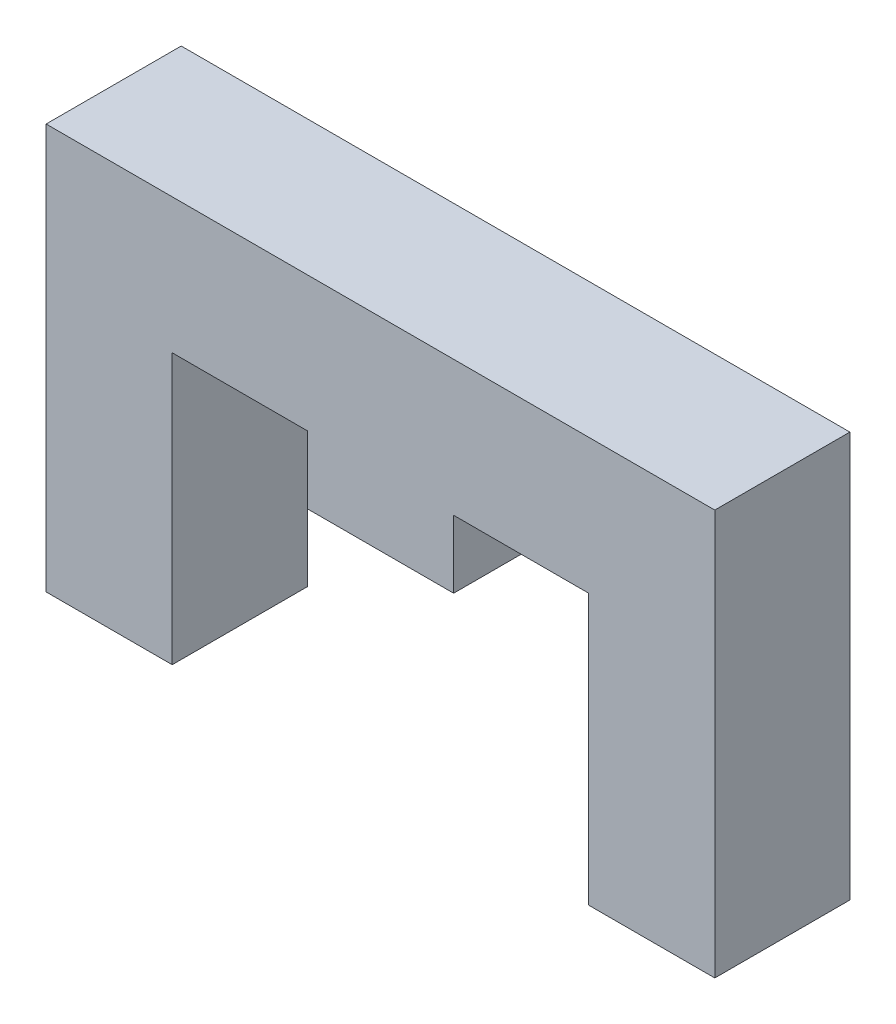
ISO-10303-21;
HEADER;
FILE_DESCRIPTION(('STEP AP214'),'2;1');
FILE_NAME('part.step','',(''),(''),'','','');
FILE_SCHEMA(('AUTOMOTIVE_DESIGN { 1 0 10303 214 1 1 1 1 }'));
ENDSEC;
DATA;
#1=APPLICATION_CONTEXT('core data for automotive mechanical design processes');
#2=APPLICATION_PROTOCOL_DEFINITION('international standard','automotive_design',2000,#1);
#3=PRODUCT_CONTEXT('',#1,'mechanical');
#4=PRODUCT('Part','Part','',(#3));
#5=PRODUCT_RELATED_PRODUCT_CATEGORY('part','',(#4));
#6=PRODUCT_DEFINITION_FORMATION('','',#4);
#7=PRODUCT_DEFINITION_CONTEXT('part definition',#1,'design');
#8=PRODUCT_DEFINITION('design','',#6,#7);
#9=PRODUCT_DEFINITION_SHAPE('','',#8);
#10=(LENGTH_UNIT() NAMED_UNIT(*) SI_UNIT(.MILLI.,.METRE.));
#11=(NAMED_UNIT(*) PLANE_ANGLE_UNIT() SI_UNIT($,.RADIAN.));
#12=(NAMED_UNIT(*) SI_UNIT($,.STERADIAN.) SOLID_ANGLE_UNIT());
#13=UNCERTAINTY_MEASURE_WITH_UNIT(LENGTH_MEASURE(1.E-05),#10,'distance_accuracy_value','');
#14=(GEOMETRIC_REPRESENTATION_CONTEXT(3) GLOBAL_UNCERTAINTY_ASSIGNED_CONTEXT((#13)) GLOBAL_UNIT_ASSIGNED_CONTEXT((#10,
#11,#12)) REPRESENTATION_CONTEXT('',''));
#15=CARTESIAN_POINT('',(0.,0.,0.));
#16=DIRECTION('',(0.,0.,1.));
#17=DIRECTION('',(1.,0.,0.));
#18=AXIS2_PLACEMENT_3D('',#15,#16,#17);
#19=CARTESIAN_POINT('',(-17.85,-3.,3.));
#20=DIRECTION('',(0.,1.,0.));
#21=DIRECTION('',(-1.,0.,0.));
#22=AXIS2_PLACEMENT_3D('',#19,#20,#21);
#23=PLANE('',#22);
#24=DIRECTION('',(1.,0.,0.));
#25=VECTOR('',#24,1.);
#26=CARTESIAN_POINT('',(-17.85,-3.,0.));
#27=LINE('',#26,#25);
#28=CARTESIAN_POINT('',(-17.85,-3.,0.));
#29=VERTEX_POINT('',#28);
#30=CARTESIAN_POINT('',(-15.05,-3.,0.));
#31=VERTEX_POINT('',#30);
#32=EDGE_CURVE('E141',#29,#31,#27,.T.);
#33=ORIENTED_EDGE('',*,*,#32,.T.);
#34=DIRECTION('',(0.,0.,-1.));
#35=VECTOR('',#34,1.);
#36=CARTESIAN_POINT('',(-15.05,-3.,3.));
#37=LINE('',#36,#35);
#38=CARTESIAN_POINT('',(-15.05,-3.,3.));
#39=VERTEX_POINT('',#38);
#40=EDGE_CURVE('E25',#39,#31,#37,.T.);
#41=ORIENTED_EDGE('',*,*,#40,.F.);
#42=DIRECTION('',(1.,0.,0.));
#43=VECTOR('',#42,1.);
#44=CARTESIAN_POINT('',(-17.85,-3.,3.));
#45=LINE('',#44,#43);
#46=CARTESIAN_POINT('',(-17.85,-3.,3.));
#47=VERTEX_POINT('',#46);
#48=EDGE_CURVE('E89',#47,#39,#45,.T.);
#49=ORIENTED_EDGE('',*,*,#48,.F.);
#50=DIRECTION('',(0.,0.,-1.));
#51=VECTOR('',#50,1.);
#52=CARTESIAN_POINT('',(-17.85,-3.,3.));
#53=LINE('',#52,#51);
#54=EDGE_CURVE('E11',#47,#29,#53,.T.);
#55=ORIENTED_EDGE('',*,*,#54,.T.);
#56=EDGE_LOOP('',(#33,#41,#49,#55));
#57=FACE_BOUND('',#56,.T.);
#58=ADVANCED_FACE('F17',(#57),#23,.F.);
#59=CARTESIAN_POINT('',(-15.05,0.,3.));
#60=DIRECTION('',(-1.,0.,0.));
#61=DIRECTION('',(0.,-1.,0.));
#62=AXIS2_PLACEMENT_3D('',#59,#60,#61);
#63=PLANE('',#62);
#64=DIRECTION('',(0.,1.,0.));
#65=VECTOR('',#64,1.);
#66=CARTESIAN_POINT('',(-15.05,0.,0.));
#67=LINE('',#66,#65);
#68=CARTESIAN_POINT('',(-15.05,6.,0.));
#69=VERTEX_POINT('',#68);
#70=EDGE_CURVE('E144',#31,#69,#67,.T.);
#71=ORIENTED_EDGE('',*,*,#70,.T.);
#72=DIRECTION('',(0.,0.,-1.));
#73=VECTOR('',#72,1.);
#74=CARTESIAN_POINT('',(-15.05,6.,3.));
#75=LINE('',#74,#73);
#76=CARTESIAN_POINT('',(-15.05,6.,3.));
#77=VERTEX_POINT('',#76);
#78=EDGE_CURVE('E183',#77,#69,#75,.T.);
#79=ORIENTED_EDGE('',*,*,#78,.F.);
#80=DIRECTION('',(0.,1.,0.));
#81=VECTOR('',#80,1.);
#82=CARTESIAN_POINT('',(-15.05,-3.,3.));
#83=LINE('',#82,#81);
#84=EDGE_CURVE('E190',#39,#77,#83,.T.);
#85=ORIENTED_EDGE('',*,*,#84,.F.);
#86=ORIENTED_EDGE('',*,*,#40,.T.);
#87=EDGE_LOOP('',(#71,#79,#85,#86));
#88=FACE_BOUND('',#87,.T.);
#89=ADVANCED_FACE('F188',(#88),#63,.F.);
#90=CARTESIAN_POINT('',(-15.05,6.,3.));
#91=DIRECTION('',(0.,-1.,0.));
#92=DIRECTION('',(1.,0.,0.));
#93=AXIS2_PLACEMENT_3D('',#90,#91,#92);
#94=PLANE('',#93);
#95=DIRECTION('',(-1.,0.,0.));
#96=VECTOR('',#95,1.);
#97=CARTESIAN_POINT('',(-15.05,6.,0.));
#98=LINE('',#97,#96);
#99=CARTESIAN_POINT('',(-29.9,6.,0.));
#100=VERTEX_POINT('',#99);
#101=EDGE_CURVE('E146',#69,#100,#98,.T.);
#102=ORIENTED_EDGE('',*,*,#101,.T.);
#103=DIRECTION('',(0.,0.,-1.));
#104=VECTOR('',#103,1.);
#105=CARTESIAN_POINT('',(-29.9,6.,3.));
#106=LINE('',#105,#104);
#107=CARTESIAN_POINT('',(-29.9,6.,3.));
#108=VERTEX_POINT('',#107);
#109=EDGE_CURVE('E180',#108,#100,#106,.T.);
#110=ORIENTED_EDGE('',*,*,#109,.F.);
#111=DIRECTION('',(-1.,0.,0.));
#112=VECTOR('',#111,1.);
#113=CARTESIAN_POINT('',(-15.05,6.,3.));
#114=LINE('',#113,#112);
#115=EDGE_CURVE('E208',#77,#108,#114,.T.);
#116=ORIENTED_EDGE('',*,*,#115,.F.);
#117=ORIENTED_EDGE('',*,*,#78,.T.);
#118=EDGE_LOOP('',(#102,#110,#116,#117));
#119=FACE_BOUND('',#118,.T.);
#120=ADVANCED_FACE('F199',(#119),#94,.F.);
#121=CARTESIAN_POINT('',(-29.9,0.,3.));
#122=DIRECTION('',(1.,0.,0.));
#123=DIRECTION('',(0.,0.,-1.));
#124=AXIS2_PLACEMENT_3D('',#121,#122,#123);
#125=PLANE('',#124);
#126=DIRECTION('',(0.,-1.,0.));
#127=VECTOR('',#126,1.);
#128=CARTESIAN_POINT('',(-29.9,0.,0.));
#129=LINE('',#128,#127);
#130=CARTESIAN_POINT('',(-29.9,-3.,0.));
#131=VERTEX_POINT('',#130);
#132=EDGE_CURVE('E149',#100,#131,#129,.T.);
#133=ORIENTED_EDGE('',*,*,#132,.T.);
#134=DIRECTION('',(0.,0.,-1.));
#135=VECTOR('',#134,1.);
#136=CARTESIAN_POINT('',(-29.9,-3.,3.));
#137=LINE('',#136,#135);
#138=CARTESIAN_POINT('',(-29.9,-3.,3.));
#139=VERTEX_POINT('',#138);
#140=EDGE_CURVE('E177',#139,#131,#137,.T.);
#141=ORIENTED_EDGE('',*,*,#140,.F.);
#142=DIRECTION('',(0.,-1.,0.));
#143=VECTOR('',#142,1.);
#144=CARTESIAN_POINT('',(-29.9,0.,3.));
#145=LINE('',#144,#143);
#146=EDGE_CURVE('E205',#108,#139,#145,.T.);
#147=ORIENTED_EDGE('',*,*,#146,.F.);
#148=ORIENTED_EDGE('',*,*,#109,.T.);
#149=EDGE_LOOP('',(#133,#141,#147,#148));
#150=FACE_BOUND('',#149,.T.);
#151=ADVANCED_FACE('F203',(#150),#125,.F.);
#152=CARTESIAN_POINT('',(-29.9,-3.,3.));
#153=DIRECTION('',(0.,1.,0.));
#154=DIRECTION('',(-1.,0.,0.));
#155=AXIS2_PLACEMENT_3D('',#152,#153,#154);
#156=PLANE('',#155);
#157=DIRECTION('',(1.,0.,0.));
#158=VECTOR('',#157,1.);
#159=CARTESIAN_POINT('',(-29.9,-3.,0.));
#160=LINE('',#159,#158);
#161=CARTESIAN_POINT('',(-27.1,-3.,0.));
#162=VERTEX_POINT('',#161);
#163=EDGE_CURVE('E151',#131,#162,#160,.T.);
#164=ORIENTED_EDGE('',*,*,#163,.T.);
#165=DIRECTION('',(0.,0.,-1.));
#166=VECTOR('',#165,1.);
#167=CARTESIAN_POINT('',(-27.1,-3.,3.));
#168=LINE('',#167,#166);
#169=CARTESIAN_POINT('',(-27.1,-3.,3.));
#170=VERTEX_POINT('',#169);
#171=EDGE_CURVE('E174',#170,#162,#168,.T.);
#172=ORIENTED_EDGE('',*,*,#171,.F.);
#173=DIRECTION('',(1.,0.,0.));
#174=VECTOR('',#173,1.);
#175=CARTESIAN_POINT('',(-29.9,-3.,3.));
#176=LINE('',#175,#174);
#177=EDGE_CURVE('E207',#139,#170,#176,.T.);
#178=ORIENTED_EDGE('',*,*,#177,.F.);
#179=ORIENTED_EDGE('',*,*,#140,.T.);
#180=EDGE_LOOP('',(#164,#172,#178,#179));
#181=FACE_BOUND('',#180,.T.);
#182=ADVANCED_FACE('F230',(#181),#156,.F.);
#183=CARTESIAN_POINT('',(-27.1,0.,3.));
#184=DIRECTION('',(-1.,0.,0.));
#185=DIRECTION('',(0.,-1.,0.));
#186=AXIS2_PLACEMENT_3D('',#183,#184,#185);
#187=PLANE('',#186);
#188=DIRECTION('',(0.,1.,0.));
#189=VECTOR('',#188,1.);
#190=CARTESIAN_POINT('',(-27.1,0.,0.));
#191=LINE('',#190,#189);
#192=CARTESIAN_POINT('',(-27.1,3.,0.));
#193=VERTEX_POINT('',#192);
#194=EDGE_CURVE('E154',#162,#193,#191,.T.);
#195=ORIENTED_EDGE('',*,*,#194,.T.);
#196=DIRECTION('',(0.,0.,-1.));
#197=VECTOR('',#196,1.);
#198=CARTESIAN_POINT('',(-27.1,3.,3.));
#199=LINE('',#198,#197);
#200=CARTESIAN_POINT('',(-27.1,3.,3.));
#201=VERTEX_POINT('',#200);
#202=EDGE_CURVE('E171',#201,#193,#199,.T.);
#203=ORIENTED_EDGE('',*,*,#202,.F.);
#204=DIRECTION('',(0.,1.,0.));
#205=VECTOR('',#204,1.);
#206=CARTESIAN_POINT('',(-27.1,-3.,3.));
#207=LINE('',#206,#205);
#208=EDGE_CURVE('E210',#170,#201,#207,.T.);
#209=ORIENTED_EDGE('',*,*,#208,.F.);
#210=ORIENTED_EDGE('',*,*,#171,.T.);
#211=EDGE_LOOP('',(#195,#203,#209,#210));
#212=FACE_BOUND('',#211,.T.);
#213=ADVANCED_FACE('F231',(#212),#187,.F.);
#214=CARTESIAN_POINT('',(-27.1,3.,3.));
#215=DIRECTION('',(0.,1.,0.));
#216=DIRECTION('',(0.,0.,1.));
#217=AXIS2_PLACEMENT_3D('',#214,#215,#216);
#218=PLANE('',#217);
#219=DIRECTION('',(1.,0.,0.));
#220=VECTOR('',#219,1.);
#221=CARTESIAN_POINT('',(-27.1,3.,0.));
#222=LINE('',#221,#220);
#223=CARTESIAN_POINT('',(-24.1,3.,0.));
#224=VERTEX_POINT('',#223);
#225=EDGE_CURVE('E156',#193,#224,#222,.T.);
#226=ORIENTED_EDGE('',*,*,#225,.T.);
#227=DIRECTION('',(0.,0.,-1.));
#228=VECTOR('',#227,1.);
#229=CARTESIAN_POINT('',(-24.1,3.,3.));
#230=LINE('',#229,#228);
#231=CARTESIAN_POINT('',(-24.1,3.,3.));
#232=VERTEX_POINT('',#231);
#233=EDGE_CURVE('E168',#232,#224,#230,.T.);
#234=ORIENTED_EDGE('',*,*,#233,.F.);
#235=DIRECTION('',(1.,0.,0.));
#236=VECTOR('',#235,1.);
#237=CARTESIAN_POINT('',(-27.1,3.,3.));
#238=LINE('',#237,#236);
#239=EDGE_CURVE('E216',#201,#232,#238,.T.);
#240=ORIENTED_EDGE('',*,*,#239,.F.);
#241=ORIENTED_EDGE('',*,*,#202,.T.);
#242=EDGE_LOOP('',(#226,#234,#240,#241));
#243=FACE_BOUND('',#242,.T.);
#244=ADVANCED_FACE('F222',(#243),#218,.F.);
#245=CARTESIAN_POINT('',(-24.1,3.,3.));
#246=DIRECTION('',(1.,0.,0.));
#247=DIRECTION('',(0.,0.,-1.));
#248=AXIS2_PLACEMENT_3D('',#245,#246,#247);
#249=PLANE('',#248);
#250=DIRECTION('',(0.,-1.,0.));
#251=VECTOR('',#250,1.);
#252=CARTESIAN_POINT('',(-24.1,3.,0.));
#253=LINE('',#252,#251);
#254=CARTESIAN_POINT('',(-24.1,1.5,0.));
#255=VERTEX_POINT('',#254);
#256=EDGE_CURVE('E158',#224,#255,#253,.T.);
#257=ORIENTED_EDGE('',*,*,#256,.T.);
#258=DIRECTION('',(0.,0.,-1.));
#259=VECTOR('',#258,1.);
#260=CARTESIAN_POINT('',(-24.1,1.5,3.));
#261=LINE('',#260,#259);
#262=CARTESIAN_POINT('',(-24.1,1.5,3.));
#263=VERTEX_POINT('',#262);
#264=EDGE_CURVE('E130',#263,#255,#261,.T.);
#265=ORIENTED_EDGE('',*,*,#264,.F.);
#266=DIRECTION('',(0.,-1.,0.));
#267=VECTOR('',#266,1.);
#268=CARTESIAN_POINT('',(-24.1,3.,3.));
#269=LINE('',#268,#267);
#270=EDGE_CURVE('E121',#232,#263,#269,.T.);
#271=ORIENTED_EDGE('',*,*,#270,.F.);
#272=ORIENTED_EDGE('',*,*,#233,.T.);
#273=EDGE_LOOP('',(#257,#265,#271,#272));
#274=FACE_BOUND('',#273,.T.);
#275=ADVANCED_FACE('F226',(#274),#249,.F.);
#276=CARTESIAN_POINT('',(-24.1,1.5,3.));
#277=DIRECTION('',(0.,1.,0.));
#278=DIRECTION('',(-1.,0.,0.));
#279=AXIS2_PLACEMENT_3D('',#276,#277,#278);
#280=PLANE('',#279);
#281=DIRECTION('',(1.,0.,0.));
#282=VECTOR('',#281,1.);
#283=CARTESIAN_POINT('',(-24.1,1.5,0.));
#284=LINE('',#283,#282);
#285=CARTESIAN_POINT('',(-20.85,1.5,0.));
#286=VERTEX_POINT('',#285);
#287=EDGE_CURVE('E129',#255,#286,#284,.T.);
#288=ORIENTED_EDGE('',*,*,#287,.T.);
#289=DIRECTION('',(0.,0.,-1.));
#290=VECTOR('',#289,1.);
#291=CARTESIAN_POINT('',(-20.85,1.5,3.));
#292=LINE('',#291,#290);
#293=CARTESIAN_POINT('',(-20.85,1.5,3.));
#294=VERTEX_POINT('',#293);
#295=EDGE_CURVE('E126',#294,#286,#292,.T.);
#296=ORIENTED_EDGE('',*,*,#295,.F.);
#297=DIRECTION('',(1.,0.,0.));
#298=VECTOR('',#297,1.);
#299=CARTESIAN_POINT('',(-24.1,1.5,3.));
#300=LINE('',#299,#298);
#301=EDGE_CURVE('E115',#263,#294,#300,.T.);
#302=ORIENTED_EDGE('',*,*,#301,.F.);
#303=ORIENTED_EDGE('',*,*,#264,.T.);
#304=EDGE_LOOP('',(#288,#296,#302,#303));
#305=FACE_BOUND('',#304,.T.);
#306=ADVANCED_FACE('F127',(#305),#280,.F.);
#307=CARTESIAN_POINT('',(-20.85,3.,3.));
#308=DIRECTION('',(-1.,0.,0.));
#309=DIRECTION('',(0.,-1.,0.));
#310=AXIS2_PLACEMENT_3D('',#307,#308,#309);
#311=PLANE('',#310);
#312=DIRECTION('',(0.,1.,0.));
#313=VECTOR('',#312,1.);
#314=CARTESIAN_POINT('',(-20.85,3.,0.));
#315=LINE('',#314,#313);
#316=CARTESIAN_POINT('',(-20.85,3.,0.));
#317=VERTEX_POINT('',#316);
#318=EDGE_CURVE('E75',#286,#317,#315,.T.);
#319=ORIENTED_EDGE('',*,*,#318,.T.);
#320=DIRECTION('',(0.,0.,-1.));
#321=VECTOR('',#320,1.);
#322=CARTESIAN_POINT('',(-20.85,3.,3.));
#323=LINE('',#322,#321);
#324=CARTESIAN_POINT('',(-20.85,3.,3.));
#325=VERTEX_POINT('',#324);
#326=EDGE_CURVE('E131',#325,#317,#323,.T.);
#327=ORIENTED_EDGE('',*,*,#326,.F.);
#328=DIRECTION('',(0.,1.,0.));
#329=VECTOR('',#328,1.);
#330=CARTESIAN_POINT('',(-20.85,3.,3.));
#331=LINE('',#330,#329);
#332=EDGE_CURVE('E119',#294,#325,#331,.T.);
#333=ORIENTED_EDGE('',*,*,#332,.F.);
#334=ORIENTED_EDGE('',*,*,#295,.T.);
#335=EDGE_LOOP('',(#319,#327,#333,#334));
#336=FACE_BOUND('',#335,.T.);
#337=ADVANCED_FACE('F133',(#336),#311,.F.);
#338=CARTESIAN_POINT('',(-20.85,3.,3.));
#339=DIRECTION('',(0.,1.,0.));
#340=DIRECTION('',(-1.,0.,0.));
#341=AXIS2_PLACEMENT_3D('',#338,#339,#340);
#342=PLANE('',#341);
#343=DIRECTION('',(1.,0.,0.));
#344=VECTOR('',#343,1.);
#345=CARTESIAN_POINT('',(-20.85,3.,0.));
#346=LINE('',#345,#344);
#347=CARTESIAN_POINT('',(-17.85,3.,0.));
#348=VERTEX_POINT('',#347);
#349=EDGE_CURVE('E82',#317,#348,#346,.T.);
#350=ORIENTED_EDGE('',*,*,#349,.T.);
#351=DIRECTION('',(0.,0.,-1.));
#352=VECTOR('',#351,1.);
#353=CARTESIAN_POINT('',(-17.85,3.,3.));
#354=LINE('',#353,#352);
#355=CARTESIAN_POINT('',(-17.85,3.,3.));
#356=VERTEX_POINT('',#355);
#357=EDGE_CURVE('E137',#356,#348,#354,.T.);
#358=ORIENTED_EDGE('',*,*,#357,.F.);
#359=DIRECTION('',(1.,0.,0.));
#360=VECTOR('',#359,1.);
#361=CARTESIAN_POINT('',(-20.85,3.,3.));
#362=LINE('',#361,#360);
#363=EDGE_CURVE('E135',#325,#356,#362,.T.);
#364=ORIENTED_EDGE('',*,*,#363,.F.);
#365=ORIENTED_EDGE('',*,*,#326,.T.);
#366=EDGE_LOOP('',(#350,#358,#364,#365));
#367=FACE_BOUND('',#366,.T.);
#368=ADVANCED_FACE('F304',(#367),#342,.F.);
#369=CARTESIAN_POINT('',(-17.85,3.,3.));
#370=DIRECTION('',(1.,0.,0.));
#371=DIRECTION('',(0.,1.,0.));
#372=AXIS2_PLACEMENT_3D('',#369,#370,#371);
#373=PLANE('',#372);
#374=DIRECTION('',(0.,-1.,0.));
#375=VECTOR('',#374,1.);
#376=CARTESIAN_POINT('',(-17.85,3.,0.));
#377=LINE('',#376,#375);
#378=EDGE_CURVE('E163',#348,#29,#377,.T.);
#379=ORIENTED_EDGE('',*,*,#378,.T.);
#380=ORIENTED_EDGE('',*,*,#54,.F.);
#381=DIRECTION('',(0.,-1.,0.));
#382=VECTOR('',#381,1.);
#383=CARTESIAN_POINT('',(-17.85,0.,3.));
#384=LINE('',#383,#382);
#385=EDGE_CURVE('E33',#356,#47,#384,.T.);
#386=ORIENTED_EDGE('',*,*,#385,.F.);
#387=ORIENTED_EDGE('',*,*,#357,.T.);
#388=EDGE_LOOP('',(#379,#380,#386,#387));
#389=FACE_BOUND('',#388,.T.);
#390=ADVANCED_FACE('F313',(#389),#373,.F.);
#391=CARTESIAN_POINT('',(0.,0.,3.));
#392=DIRECTION('',(0.,0.,1.));
#393=DIRECTION('',(1.,0.,0.));
#394=AXIS2_PLACEMENT_3D('',#391,#392,#393);
#395=PLANE('',#394);
#396=ORIENTED_EDGE('',*,*,#385,.T.);
#397=ORIENTED_EDGE('',*,*,#48,.T.);
#398=ORIENTED_EDGE('',*,*,#84,.T.);
#399=ORIENTED_EDGE('',*,*,#115,.T.);
#400=ORIENTED_EDGE('',*,*,#146,.T.);
#401=ORIENTED_EDGE('',*,*,#177,.T.);
#402=ORIENTED_EDGE('',*,*,#208,.T.);
#403=ORIENTED_EDGE('',*,*,#239,.T.);
#404=ORIENTED_EDGE('',*,*,#270,.T.);
#405=ORIENTED_EDGE('',*,*,#301,.T.);
#406=ORIENTED_EDGE('',*,*,#332,.T.);
#407=ORIENTED_EDGE('',*,*,#363,.T.);
#408=EDGE_LOOP('',(#396,#397,#398,#399,#400,#401,#402,#403,#404,#405,#406,#407));
#409=FACE_BOUND('',#408,.T.);
#410=ADVANCED_FACE('F117',(#409),#395,.T.);
#411=CARTESIAN_POINT('',(0.,0.,0.));
#412=DIRECTION('',(0.,0.,1.));
#413=DIRECTION('',(1.,0.,0.));
#414=AXIS2_PLACEMENT_3D('',#411,#412,#413);
#415=PLANE('',#414);
#416=ORIENTED_EDGE('',*,*,#32,.F.);
#417=ORIENTED_EDGE('',*,*,#378,.F.);
#418=ORIENTED_EDGE('',*,*,#349,.F.);
#419=ORIENTED_EDGE('',*,*,#318,.F.);
#420=ORIENTED_EDGE('',*,*,#287,.F.);
#421=ORIENTED_EDGE('',*,*,#256,.F.);
#422=ORIENTED_EDGE('',*,*,#225,.F.);
#423=ORIENTED_EDGE('',*,*,#194,.F.);
#424=ORIENTED_EDGE('',*,*,#163,.F.);
#425=ORIENTED_EDGE('',*,*,#132,.F.);
#426=ORIENTED_EDGE('',*,*,#101,.F.);
#427=ORIENTED_EDGE('',*,*,#70,.F.);
#428=EDGE_LOOP('',(#416,#417,#418,#419,#420,#421,#422,#423,#424,#425,#426,#427));
#429=FACE_BOUND('',#428,.T.);
#430=ADVANCED_FACE('F194',(#429),#415,.F.);
#431=CLOSED_SHELL('',(#58,#89,#120,#151,#182,#213,#244,#275,#306,#337,#368,#390,#410,#430));
#432=MANIFOLD_SOLID_BREP('B1',#431);
#433=ADVANCED_BREP_SHAPE_REPRESENTATION('',(#18,#432),#14);
#434=SHAPE_DEFINITION_REPRESENTATION(#9,#433);
ENDSEC;
END-ISO-10303-21;
